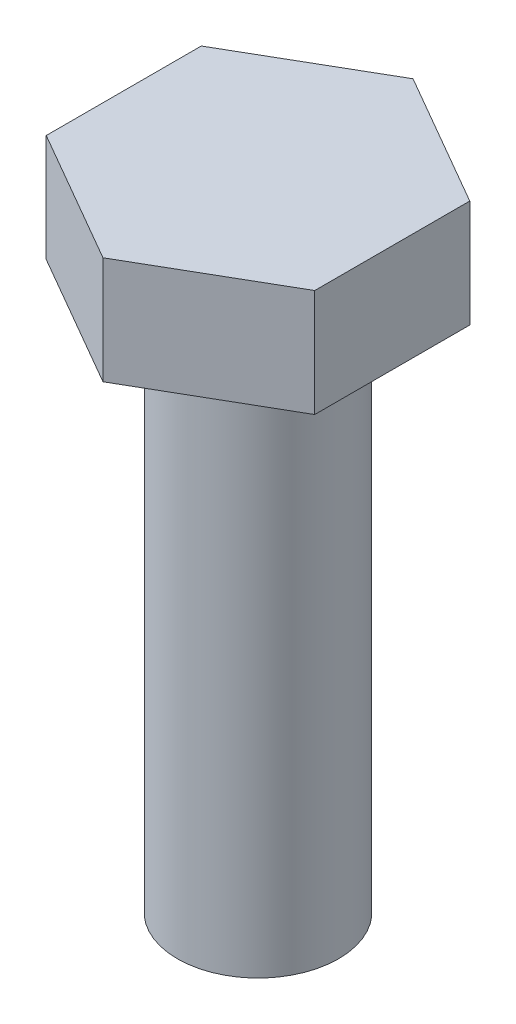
from build123d import *

# Parameters (mm, degrees)
EXTRUDE_1_DEPTH = 4
SKETCH_2_R      = 3
EXTRUDE_2_DEPTH = 20


with BuildPart() as part:
    # Sketch 1 → Extrude 1 (new body)
    with BuildSketch(Plane(origin=(0, 0, 0), x_dir=(1, 0, 0), z_dir=(0, 1, 0))):
        Polygon((0, 5.773502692), (-5, 2.886751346), (-5, -2.886751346), (0, -5.773502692), (5, -2.886751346), (5, 2.886751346), align=None)
    extrude(amount=EXTRUDE_1_DEPTH)

    # Sketch 2 → Extrude 2 (add)
    with BuildSketch(Plane(origin=(0, 0, 0), x_dir=(1, 0, 0), z_dir=(0, 1, 0))):
        with Locations(Location((0, 0, 0), (0, 0, 270))):
            Circle(SKETCH_2_R)
    extrude(amount=-EXTRUDE_2_DEPTH)


solid = part.part
